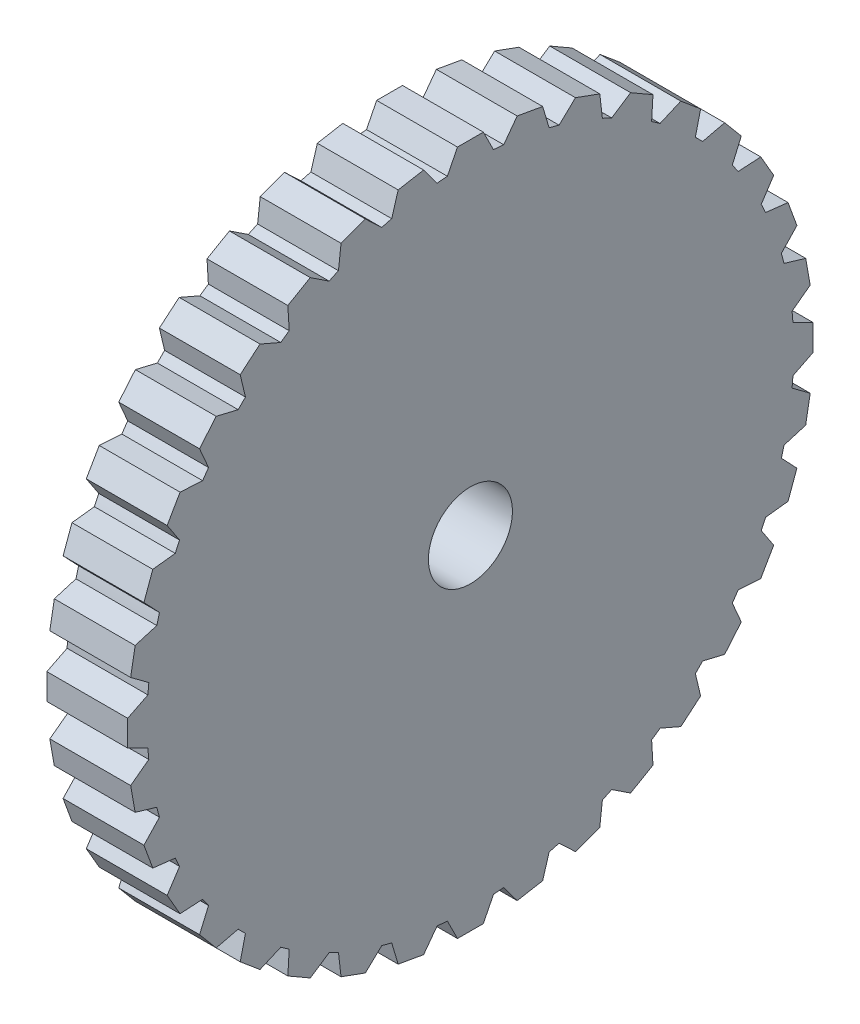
from build123d import *

# Parameters (mm, degrees)
SKETCH1_R           = 12.7
BOSS_EXTRUDE1_DEPTH = 3.175
BOSS_EXTRUDE2_DEPTH = 3.175
SKETCH3_R           = 1.651
CUT_EXTRUDE1_DEPTH  = 3.175


with BuildPart() as part:
    # Sketch1 → Boss-Extrude1 (new body)
    with BuildSketch(Plane(origin=(0, 0, 0), x_dir=(0, 0, -1), z_dir=(1, 0, 0))):
        Circle(SKETCH1_R)
    extrude(amount=BOSS_EXTRUDE1_DEPTH)

    # Sketch2 → Boss-Extrude2 (add)
    with BuildSketch(Plane(origin=(3.175, 0, 0), x_dir=(0, 0, -1), z_dir=(1, 0, 0))):
        Polygon((1.837369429, 13.345695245), (2.837934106, 13.169268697), (3.161789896, 12.080490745), (1.160660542, 12.433343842), align=None)
        Polygon((-0.508, 13.462), (0.508, 13.462), (1.016, 12.446), (-1.016, 12.446), align=None)
        Polygon((4.126911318, 12.823888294), (5.081639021, 12.476395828), (5.211510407, 11.347921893), (3.302055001, 12.042906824), align=None)
        Polygon((6.291059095, 11.912433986), (7.170940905, 11.404433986), (7.10288181, 10.270552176), (5.34311819, 11.286552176), align=None)
        Polygon((8.264056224, 10.639026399), (9.042357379, 9.985954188), (8.778435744, 8.881116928), (7.221833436, 10.187261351), align=None)
        Polygon((9.985954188, 9.042357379), (10.639026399, 8.264056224), (10.187261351, 7.221833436), (8.881116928, 8.778435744), align=None)
        Polygon((11.404433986, 7.170940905), (11.912433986, 6.291059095), (11.286552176, 5.34311819), (10.270552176, 7.10288181), align=None)
        Polygon((12.476395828, 5.081639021), (12.823888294, 4.126911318), (12.042906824, 3.302055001), (11.347921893, 5.211510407), align=None)
        Polygon((13.169268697, 2.837934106), (13.345695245, 1.837369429), (12.433343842, 1.160660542), (12.080490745, 3.161789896), align=None)
        Polygon((13.462, 0.508), (13.462, -0.508), (12.446, -1.016), (12.446, 1.016), align=None)
        Polygon((13.345695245, -1.837369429), (13.169268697, -2.837934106), (12.080490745, -3.161789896), (12.433343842, -1.160660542), align=None)
        Polygon((12.823888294, -4.126911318), (12.476395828, -5.081639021), (11.347921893, -5.211510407), (12.042906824, -3.302055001), align=None)
        Polygon((11.912433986, -6.291059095), (11.404433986, -7.170940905), (10.270552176, -7.10288181), (11.286552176, -5.34311819), align=None)
        Polygon((10.639026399, -8.264056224), (9.985954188, -9.042357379), (8.881116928, -8.778435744), (10.187261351, -7.221833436), align=None)
        Polygon((9.042357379, -9.985954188), (8.264056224, -10.639026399), (7.221833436, -10.187261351), (8.778435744, -8.881116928), align=None)
        Polygon((7.170940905, -11.404433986), (6.291059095, -11.912433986), (5.34311819, -11.286552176), (7.10288181, -10.270552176), align=None)
        Polygon((5.081639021, -12.476395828), (4.126911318, -12.823888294), (3.302055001, -12.042906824), (5.211510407, -11.347921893), align=None)
        Polygon((2.837934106, -13.169268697), (1.837369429, -13.345695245), (1.160660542, -12.433343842), (3.161789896, -12.080490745), align=None)
        Polygon((0.508, -13.462), (-0.508, -13.462), (-1.016, -12.446), (1.016, -12.446), align=None)
        Polygon((-1.837369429, -13.345695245), (-2.837934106, -13.169268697), (-3.161789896, -12.080490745), (-1.160660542, -12.433343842), align=None)
        Polygon((-4.126911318, -12.823888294), (-5.081639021, -12.476395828), (-5.211510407, -11.347921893), (-3.302055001, -12.042906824), align=None)
        Polygon((-6.291059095, -11.912433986), (-7.170940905, -11.404433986), (-7.10288181, -10.270552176), (-5.34311819, -11.286552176), align=None)
        Polygon((-8.264056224, -10.639026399), (-9.042357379, -9.985954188), (-8.778435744, -8.881116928), (-7.221833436, -10.187261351), align=None)
        Polygon((-9.985954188, -9.042357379), (-10.639026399, -8.264056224), (-10.187261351, -7.221833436), (-8.881116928, -8.778435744), align=None)
        Polygon((-11.404433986, -7.170940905), (-11.912433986, -6.291059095), (-11.286552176, -5.34311819), (-10.270552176, -7.10288181), align=None)
        Polygon((-12.476395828, -5.081639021), (-12.823888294, -4.126911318), (-12.042906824, -3.302055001), (-11.347921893, -5.211510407), align=None)
        Polygon((-13.169268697, -2.837934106), (-13.345695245, -1.837369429), (-12.433343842, -1.160660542), (-12.080490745, -3.161789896), align=None)
        Polygon((-13.462, -0.508), (-13.462, 0.508), (-12.446, 1.016), (-12.446, -1.016), align=None)
        Polygon((-13.345695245, 1.837369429), (-13.169268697, 2.837934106), (-12.080490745, 3.161789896), (-12.433343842, 1.160660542), align=None)
        Polygon((-12.823888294, 4.126911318), (-12.476395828, 5.081639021), (-11.347921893, 5.211510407), (-12.042906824, 3.302055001), align=None)
        Polygon((-11.912433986, 6.291059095), (-11.404433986, 7.170940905), (-10.270552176, 7.10288181), (-11.286552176, 5.34311819), align=None)
        Polygon((-10.639026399, 8.264056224), (-9.985954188, 9.042357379), (-8.881116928, 8.778435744), (-10.187261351, 7.221833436), align=None)
        Polygon((-9.042357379, 9.985954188), (-8.264056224, 10.639026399), (-7.221833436, 10.187261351), (-8.778435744, 8.881116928), align=None)
        Polygon((-7.170940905, 11.404433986), (-6.291059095, 11.912433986), (-5.34311819, 11.286552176), (-7.10288181, 10.270552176), align=None)
        Polygon((-5.081639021, 12.476395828), (-4.126911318, 12.823888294), (-3.302055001, 12.042906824), (-5.211510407, 11.347921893), align=None)
        Polygon((-2.837934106, 13.169268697), (-1.837369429, 13.345695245), (-1.160660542, 12.433343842), (-3.161789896, 12.080490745), align=None)
    extrude(amount=-BOSS_EXTRUDE2_DEPTH)

    # Sketch3 → Cut-Extrude1 (cut)
    with BuildSketch(Plane(origin=(3.175, 0, 0), x_dir=(0, 0, -1), z_dir=(1, 0, 0))):
        Circle(SKETCH3_R)
    extrude(amount=-CUT_EXTRUDE1_DEPTH, mode=Mode.SUBTRACT)


solid = part.part
